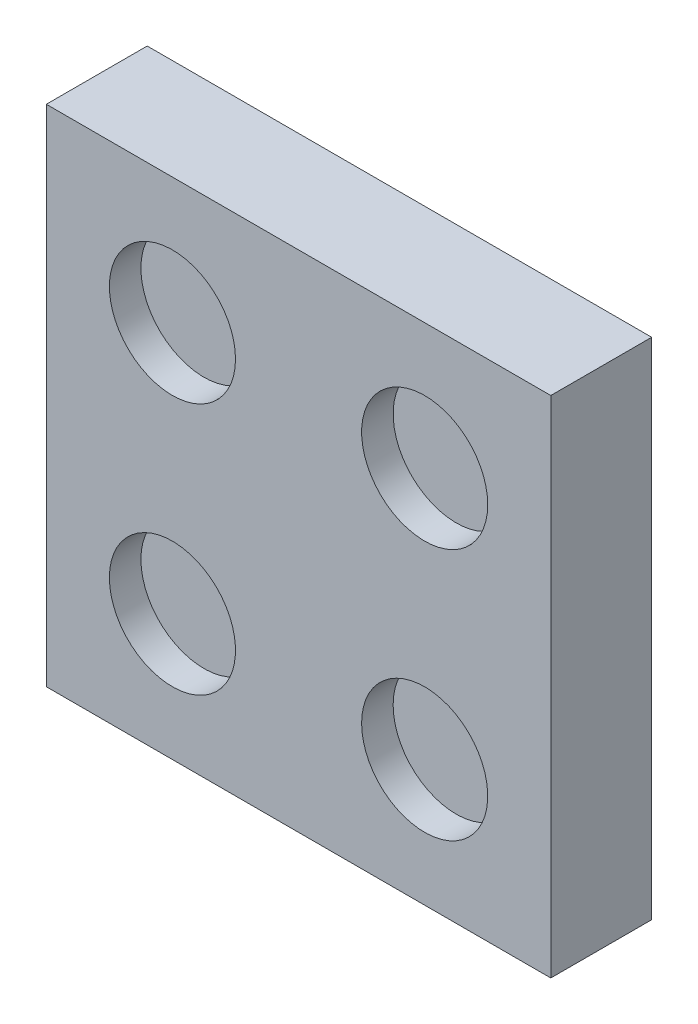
from build123d import *

# Parameters (mm, degrees)
SKETCH1_W           = 50.8
SKETCH1_H           = 50.8
BOSS_EXTRUDE1_DEPTH = 10.16
SKETCH3_R           = 6.35
SKETCH3_R_2         = 2.54
CUT_EXTRUDE2_DEPTH  = 3.175
SKETCH6_R           = 12.7
CUT_EXTRUDE3_DEPTH  = 5.08
SKETCH8_W           = 2.54
SKETCH8_H           = 12.753282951
CUT_EXTRUDE6_DEPTH  = 5.08


with BuildPart() as part:
    # Sketch1 → Boss-Extrude1 (new body)
    with BuildSketch(Plane.XY):
        with Locations((25.4, 25.4)):
            Rectangle(SKETCH1_W, SKETCH1_H)
    extrude(amount=BOSS_EXTRUDE1_DEPTH)

    # Sketch3 → Cut-Extrude2 (cut)
    with BuildSketch(Plane.XY.offset(10.16)):
        with Locations((12.7, 139.7)):
            Circle(SKETCH3_R)
        with Locations((38.1, 139.7)):
            Circle(SKETCH3_R)
        with Locations((63.5, 139.7)):
            Circle(SKETCH3_R_2)
        with Locations((88.9, 139.7)):
            Circle(SKETCH3_R_2)
        with Locations((88.9, 114.3)):
            Circle(SKETCH3_R_2)
        with Locations((63.5, 114.3)):
            Circle(SKETCH3_R_2)
        with Locations((38.1, 114.3)):
            Circle(SKETCH3_R)
        with Locations((12.7, 114.3)):
            Circle(SKETCH3_R)
        with Locations((88.9, 88.9)):
            Circle(SKETCH3_R_2)
        with Locations((63.5, 88.9)):
            Circle(SKETCH3_R_2)
        with Locations((38.1, 88.9)):
            Circle(SKETCH3_R)
        with Locations((12.7, 88.9)):
            Circle(SKETCH3_R)
        with Locations((88.9, 63.5)):
            Circle(SKETCH3_R_2)
        with Locations((63.5, 63.5)):
            Circle(SKETCH3_R_2)
        with Locations((38.1, 63.5)):
            Circle(SKETCH3_R)
        with Locations((12.7, 63.5)):
            Circle(SKETCH3_R)
        with Locations((88.9, 38.1)):
            Circle(SKETCH3_R_2)
        with Locations((63.5, 38.1)):
            Circle(SKETCH3_R_2)
        with Locations((38.1, 38.1)):
            Circle(SKETCH3_R)
        with Locations((12.7, 38.1)):
            Circle(SKETCH3_R)
        with Locations((88.9, 12.7)):
            Circle(SKETCH3_R_2)
        with Locations((63.5, 12.7)):
            Circle(SKETCH3_R_2)
        with Locations(Location((38.1, 12.7, 0), (0, 0, 180))):
            Circle(SKETCH3_R)
        with Locations(Location((12.7, 12.7, 0), (0, 0, 180))):
            Circle(SKETCH3_R)
    extrude(amount=-CUT_EXTRUDE2_DEPTH, mode=Mode.SUBTRACT)

    # Sketch6 → Cut-Extrude3 (cut)
    with BuildSketch(Plane(origin=(0, 0, 0), x_dir=(-1, 0, 0), z_dir=(0, 0, -1))):
        with Locations((-25.4, 25.4)):
            Circle(SKETCH6_R)
    extrude(amount=-CUT_EXTRUDE3_DEPTH, mode=Mode.SUBTRACT)

    # Sketch8 → Cut-Extrude6 (cut)
    with BuildSketch(Plane(origin=(0, 0, 0), x_dir=(-1, 0, 0), z_dir=(0, 0, -1))):
        with Locations((-25.292130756, 6.376641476)):
            Rectangle(SKETCH8_W, SKETCH8_H)
    extrude(amount=-CUT_EXTRUDE6_DEPTH, mode=Mode.SUBTRACT)


solid = part.part
